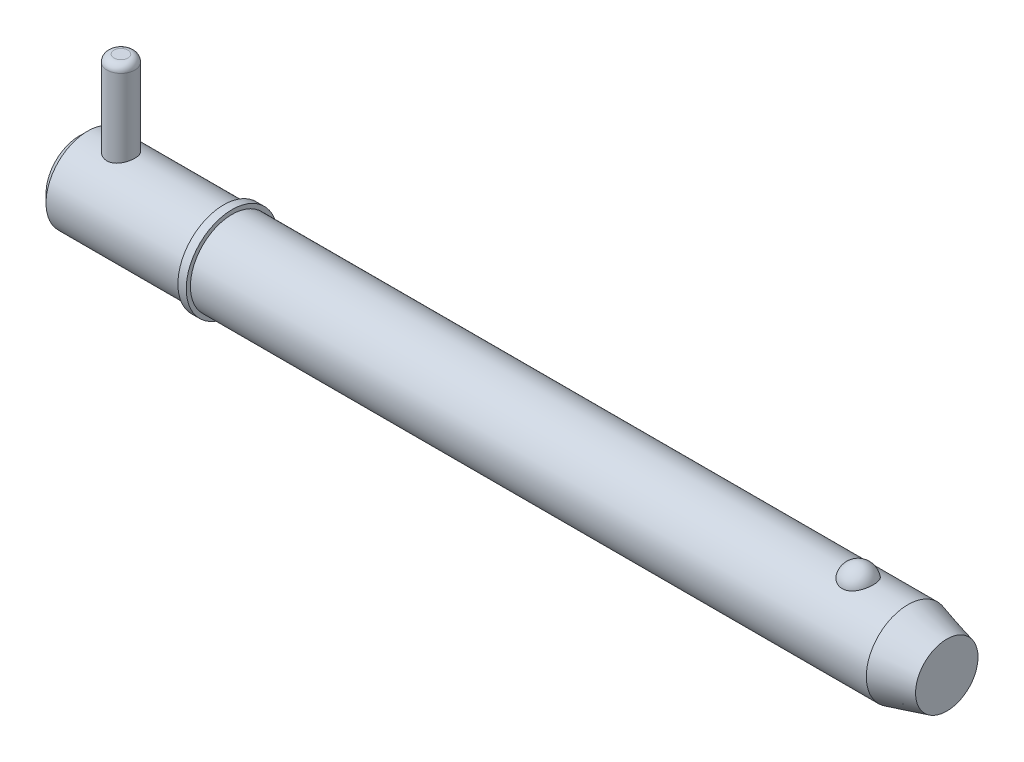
ISO-10303-21;
HEADER;
FILE_DESCRIPTION(('STEP AP214'),'2;1');
FILE_NAME('part.step','',(''),(''),'','','');
FILE_SCHEMA(('AUTOMOTIVE_DESIGN { 1 0 10303 214 1 1 1 1 }'));
ENDSEC;
DATA;
#1=APPLICATION_CONTEXT('core data for automotive mechanical design processes');
#2=APPLICATION_PROTOCOL_DEFINITION('international standard','automotive_design',2000,#1);
#3=PRODUCT_CONTEXT('',#1,'mechanical');
#4=PRODUCT('Part','Part','',(#3));
#5=PRODUCT_RELATED_PRODUCT_CATEGORY('part','',(#4));
#6=PRODUCT_DEFINITION_FORMATION('','',#4);
#7=PRODUCT_DEFINITION_CONTEXT('part definition',#1,'design');
#8=PRODUCT_DEFINITION('design','',#6,#7);
#9=PRODUCT_DEFINITION_SHAPE('','',#8);
#10=(LENGTH_UNIT() NAMED_UNIT(*) SI_UNIT(.MILLI.,.METRE.));
#11=(NAMED_UNIT(*) PLANE_ANGLE_UNIT() SI_UNIT($,.RADIAN.));
#12=(NAMED_UNIT(*) SI_UNIT($,.STERADIAN.) SOLID_ANGLE_UNIT());
#13=UNCERTAINTY_MEASURE_WITH_UNIT(LENGTH_MEASURE(1.E-05),#10,'distance_accuracy_value','');
#14=(GEOMETRIC_REPRESENTATION_CONTEXT(3) GLOBAL_UNCERTAINTY_ASSIGNED_CONTEXT((#13)) GLOBAL_UNIT_ASSIGNED_CONTEXT((#10,
#11,#12)) REPRESENTATION_CONTEXT('',''));
#15=CARTESIAN_POINT('',(0.,0.,0.));
#16=DIRECTION('',(0.,0.,1.));
#17=DIRECTION('',(1.,0.,0.));
#18=AXIS2_PLACEMENT_3D('',#15,#16,#17);
#19=CARTESIAN_POINT('',(9.52500000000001,28.575,0.));
#20=DIRECTION('',(0.,-1.,0.));
#21=DIRECTION('',(0.,0.,-1.));
#22=AXIS2_PLACEMENT_3D('',#19,#20,#21);
#23=CYLINDRICAL_SURFACE('',#22,3.175);
#24=CARTESIAN_POINT('',(9.52500000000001,-7.93750000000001,0.));
#25=DIRECTION('',(0.,1.,0.));
#26=DIRECTION('',(0.,0.,1.));
#27=AXIS2_PLACEMENT_3D('',#24,#25,#26);
#28=CIRCLE('',#27,3.175);
#29=CARTESIAN_POINT('',(9.52500000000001,-7.93750000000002,-3.175));
#30=VERTEX_POINT('',#29);
#31=EDGE_CURVE('P0_E25',#30,#30,#28,.T.);
#32=CARTESIAN_POINT('',(9.52500000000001,26.9875,0.));
#33=DIRECTION('',(0.,1.,0.));
#34=DIRECTION('',(0.,0.,1.));
#35=AXIS2_PLACEMENT_3D('',#32,#33,#34);
#36=CIRCLE('',#35,3.175);
#37=CARTESIAN_POINT('',(9.52500000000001,26.9875,-3.175));
#38=VERTEX_POINT('',#37);
#39=EDGE_CURVE('P0_E29',#38,#38,#36,.F.);
#40=CARTESIAN_POINT('',(9.52500000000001,-7.93750000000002,-3.175));
#41=CARTESIAN_POINT('',(9.52500000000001,-7.57369791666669,-3.175));
#42=CARTESIAN_POINT('',(9.52500000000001,-7.20989583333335,-3.175));
#43=CARTESIAN_POINT('',(9.52500000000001,-6.48229166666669,-3.175));
#44=CARTESIAN_POINT('',(9.52500000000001,-6.11848958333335,-3.175));
#45=CARTESIAN_POINT('',(9.52500000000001,-5.39088541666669,-3.175));
#46=CARTESIAN_POINT('',(9.52500000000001,-5.02708333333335,-3.175));
#47=CARTESIAN_POINT('',(9.52500000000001,-4.29947916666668,-3.175));
#48=CARTESIAN_POINT('',(9.52500000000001,-3.93567708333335,-3.175));
#49=CARTESIAN_POINT('',(9.52500000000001,-3.20807291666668,-3.175));
#50=CARTESIAN_POINT('',(9.52500000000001,-2.84427083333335,-3.175));
#51=CARTESIAN_POINT('',(9.52500000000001,-2.11666666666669,-3.175));
#52=CARTESIAN_POINT('',(9.52500000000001,-1.75286458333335,-3.175));
#53=CARTESIAN_POINT('',(9.52500000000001,-1.02526041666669,-3.175));
#54=CARTESIAN_POINT('',(9.52500000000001,-0.661458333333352,-3.175));
#55=CARTESIAN_POINT('',(9.52500000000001,0.0661458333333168,-3.175));
#56=CARTESIAN_POINT('',(9.52500000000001,0.429947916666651,-3.175));
#57=CARTESIAN_POINT('',(9.52500000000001,1.15755208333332,-3.175));
#58=CARTESIAN_POINT('',(9.52500000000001,1.52135416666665,-3.175));
#59=CARTESIAN_POINT('',(9.52500000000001,2.24895833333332,-3.175));
#60=CARTESIAN_POINT('',(9.52500000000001,2.61276041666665,-3.175));
#61=CARTESIAN_POINT('',(9.52500000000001,3.34036458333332,-3.175));
#62=CARTESIAN_POINT('',(9.52500000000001,3.70416666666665,-3.175));
#63=CARTESIAN_POINT('',(9.52500000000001,4.43177083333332,-3.175));
#64=CARTESIAN_POINT('',(9.52500000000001,4.79557291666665,-3.175));
#65=CARTESIAN_POINT('',(9.52500000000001,5.52317708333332,-3.175));
#66=CARTESIAN_POINT('',(9.52500000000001,5.88697916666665,-3.175));
#67=CARTESIAN_POINT('',(9.52500000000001,6.61458333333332,-3.175));
#68=CARTESIAN_POINT('',(9.52500000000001,6.97838541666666,-3.175));
#69=CARTESIAN_POINT('',(9.52500000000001,7.70598958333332,-3.175));
#70=CARTESIAN_POINT('',(9.52500000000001,8.06979166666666,-3.175));
#71=CARTESIAN_POINT('',(9.52500000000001,8.79739583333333,-3.175));
#72=CARTESIAN_POINT('',(9.52500000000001,9.16119791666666,-3.175));
#73=CARTESIAN_POINT('',(9.52500000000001,9.88880208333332,-3.175));
#74=CARTESIAN_POINT('',(9.52500000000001,10.2526041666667,-3.175));
#75=CARTESIAN_POINT('',(9.52500000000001,10.9802083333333,-3.175));
#76=CARTESIAN_POINT('',(9.52500000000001,11.3440104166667,-3.175));
#77=CARTESIAN_POINT('',(9.52500000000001,12.0716145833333,-3.175));
#78=CARTESIAN_POINT('',(9.52500000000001,12.4354166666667,-3.175));
#79=CARTESIAN_POINT('',(9.52500000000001,13.1630208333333,-3.175));
#80=CARTESIAN_POINT('',(9.52500000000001,13.5268229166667,-3.175));
#81=CARTESIAN_POINT('',(9.52500000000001,14.2544270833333,-3.175));
#82=CARTESIAN_POINT('',(9.52500000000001,14.6182291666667,-3.175));
#83=CARTESIAN_POINT('',(9.52500000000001,15.3458333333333,-3.175));
#84=CARTESIAN_POINT('',(9.52500000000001,15.7096354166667,-3.175));
#85=CARTESIAN_POINT('',(9.52500000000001,16.4372395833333,-3.175));
#86=CARTESIAN_POINT('',(9.52500000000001,16.8010416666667,-3.175));
#87=CARTESIAN_POINT('',(9.52500000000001,17.5286458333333,-3.175));
#88=CARTESIAN_POINT('',(9.52500000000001,17.8924479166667,-3.175));
#89=CARTESIAN_POINT('',(9.52500000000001,18.6200520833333,-3.175));
#90=CARTESIAN_POINT('',(9.52500000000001,18.9838541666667,-3.175));
#91=CARTESIAN_POINT('',(9.52500000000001,19.7114583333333,-3.175));
#92=CARTESIAN_POINT('',(9.52500000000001,20.0752604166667,-3.175));
#93=CARTESIAN_POINT('',(9.52500000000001,20.8028645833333,-3.175));
#94=CARTESIAN_POINT('',(9.52500000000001,21.1666666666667,-3.175));
#95=CARTESIAN_POINT('',(9.52500000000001,21.8942708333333,-3.175));
#96=CARTESIAN_POINT('',(9.52500000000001,22.2580729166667,-3.175));
#97=CARTESIAN_POINT('',(9.52500000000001,22.9856770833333,-3.175));
#98=CARTESIAN_POINT('',(9.52500000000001,23.3494791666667,-3.175));
#99=CARTESIAN_POINT('',(9.52500000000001,24.0770833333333,-3.175));
#100=CARTESIAN_POINT('',(9.52500000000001,24.4408854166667,-3.175));
#101=CARTESIAN_POINT('',(9.52500000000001,25.1684895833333,-3.175));
#102=CARTESIAN_POINT('',(9.52500000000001,25.5322916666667,-3.175));
#103=CARTESIAN_POINT('',(9.52500000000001,26.2598958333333,-3.175));
#104=CARTESIAN_POINT('',(9.52500000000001,26.6236979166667,-3.175));
#105=CARTESIAN_POINT('',(9.52500000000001,26.9875,-3.175));
#106=B_SPLINE_CURVE_WITH_KNOTS('',3,(#40,#41,#42,#43,#44,#45,#46,#47,#48,#49,#50,#51,#52,#53,
#54,#55,#56,#57,#58,#59,#60,#61,#62,#63,#64,#65,#66,#67,#68,#69,#70,#71,#72,#73,#74,#75,#76,#77,
#78,#79,#80,#81,#82,#83,#84,#85,#86,#87,#88,#89,#90,#91,#92,#93,#94,#95,#96,#97,#98,#99,#100,
#101,#102,#103,#104,#105),.UNSPECIFIED.,.F.,.F.,(4,2,2,2,2,2,2,2,2,2,2,2,2,2,2,2,2,2,2,2,2,2,2,
2,2,2,2,2,2,2,2,2,4),(0.,1.09140625,2.1828125,3.27421875,4.365625,5.45703125,6.5484375,
7.63984375,8.73125000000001,9.82265625,10.9140625,12.00546875,13.096875,14.18828125,15.2796875,
16.37109375,17.4625,18.55390625,19.6453125,20.73671875,21.828125,22.91953125,24.0109375,
25.10234375,26.19375,27.28515625,28.3765625,29.46796875,30.559375,31.65078125,32.7421875,
33.83359375,34.925),.UNSPECIFIED.);
#107=EDGE_CURVE('P0_BSEAM14',#30,#38,#106,.T.);
#108=ORIENTED_EDGE('',*,*,#31,.T.);
#109=ORIENTED_EDGE('',*,*,#39,.T.);
#110=ORIENTED_EDGE('',*,*,#107,.T.);
#111=ORIENTED_EDGE('',*,*,#107,.F.);
#112=EDGE_LOOP('',(#108,#110,#109,#111));
#113=FACE_BOUND('',#112,.T.);
#114=ADVANCED_FACE('P0_F14',(#113),#23,.T.);
#115=CARTESIAN_POINT('',(9.52500000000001,28.575,0.));
#116=DIRECTION('',(0.,1.,0.));
#117=DIRECTION('',(0.,0.,1.));
#118=AXIS2_PLACEMENT_3D('',#115,#116,#117);
#119=PLANE('',#118);
#120=CARTESIAN_POINT('',(9.52500000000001,28.575,0.));
#121=DIRECTION('',(0.,1.,0.));
#122=DIRECTION('',(0.,0.,1.));
#123=AXIS2_PLACEMENT_3D('',#120,#121,#122);
#124=CIRCLE('',#123,1.5875);
#125=CARTESIAN_POINT('',(9.52500000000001,28.575,1.5875));
#126=VERTEX_POINT('',#125);
#127=EDGE_CURVE('P0_E10',#126,#126,#124,.T.);
#128=ORIENTED_EDGE('',*,*,#127,.T.);
#129=EDGE_LOOP('',(#128));
#130=FACE_BOUND('',#129,.T.);
#131=ADVANCED_FACE('P0_F46',(#130),#119,.T.);
#132=CARTESIAN_POINT('',(9.52500000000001,-9.525,0.));
#133=DIRECTION('',(0.,1.,0.));
#134=DIRECTION('',(0.,0.,1.));
#135=AXIS2_PLACEMENT_3D('',#132,#133,#134);
#136=PLANE('',#135);
#137=CARTESIAN_POINT('',(9.52500000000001,-9.525,0.));
#138=DIRECTION('',(0.,1.,0.));
#139=DIRECTION('',(0.,0.,1.));
#140=AXIS2_PLACEMENT_3D('',#137,#138,#139);
#141=CIRCLE('',#140,1.5875);
#142=CARTESIAN_POINT('',(9.52500000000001,-9.525,1.5875));
#143=VERTEX_POINT('',#142);
#144=EDGE_CURVE('P0_E21',#143,#143,#141,.F.);
#145=ORIENTED_EDGE('',*,*,#144,.T.);
#146=EDGE_LOOP('',(#145));
#147=FACE_BOUND('',#146,.T.);
#148=ADVANCED_FACE('P0_F43',(#147),#136,.F.);
#149=CARTESIAN_POINT('',(9.52500000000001,-7.9375,0.));
#150=DIRECTION('',(0.,1.,0.));
#151=DIRECTION('',(0.,0.,1.));
#152=AXIS2_PLACEMENT_3D('',#149,#150,#151);
#153=DEGENERATE_TOROIDAL_SURFACE('',#152,1.5875,1.5875,.T.);
#154=ORIENTED_EDGE('',*,*,#144,.F.);
#155=EDGE_LOOP('',(#154));
#156=FACE_BOUND('',#155,.T.);
#157=ORIENTED_EDGE('',*,*,#31,.F.);
#158=EDGE_LOOP('',(#157));
#159=FACE_BOUND('',#158,.T.);
#160=ADVANCED_FACE('P0_F38',(#156,#159),#153,.T.);
#161=CARTESIAN_POINT('',(9.52500000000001,26.9875,0.));
#162=DIRECTION('',(0.,1.,0.));
#163=DIRECTION('',(0.,0.,1.));
#164=AXIS2_PLACEMENT_3D('',#161,#162,#163);
#165=DEGENERATE_TOROIDAL_SURFACE('',#164,1.5875,1.5875,.T.);
#166=ORIENTED_EDGE('',*,*,#39,.F.);
#167=EDGE_LOOP('',(#166));
#168=FACE_BOUND('',#167,.T.);
#169=ORIENTED_EDGE('',*,*,#127,.F.);
#170=EDGE_LOOP('',(#169));
#171=FACE_BOUND('',#170,.T.);
#172=ADVANCED_FACE('P0_F16',(#168,#171),#165,.T.);
#173=CLOSED_SHELL('',(#114,#131,#148,#160,#172));
#174=MANIFOLD_SOLID_BREP('P0_B1',#173);
#175=CARTESIAN_POINT('',(0.,0.,0.));
#176=DIRECTION('',(1.,0.,0.));
#177=DIRECTION('',(0.,0.,-1.));
#178=AXIS2_PLACEMENT_3D('',#175,#176,#177);
#179=CYLINDRICAL_SURFACE('',#178,9.525);
#180=CARTESIAN_POINT('',(189.543054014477,0.,0.));
#181=DIRECTION('',(1.,0.,0.));
#182=DIRECTION('',(0.,0.,-1.));
#183=AXIS2_PLACEMENT_3D('',#180,#181,#182);
#184=CIRCLE('',#183,9.525);
#185=CARTESIAN_POINT('',(189.543054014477,0.,-9.525));
#186=VERTEX_POINT('',#185);
#187=EDGE_CURVE('P1_E81',#186,#186,#184,.T.);
#188=ORIENTED_EDGE('',*,*,#187,.F.);
#189=EDGE_LOOP('',(#188));
#190=FACE_BOUND('',#189,.T.);
#191=CARTESIAN_POINT('',(34.93,0.,0.));
#192=DIRECTION('',(1.,0.,0.));
#193=DIRECTION('',(0.,0.,-1.));
#194=AXIS2_PLACEMENT_3D('',#191,#192,#193);
#195=CIRCLE('',#194,9.525);
#196=CARTESIAN_POINT('',(34.93,0.,-9.525));
#197=VERTEX_POINT('',#196);
#198=EDGE_CURVE('P1_E85',#197,#197,#195,.T.);
#199=ORIENTED_EDGE('',*,*,#198,.T.);
#200=EDGE_LOOP('',(#199));
#201=FACE_BOUND('',#200,.T.);
#202=CARTESIAN_POINT('',(178.145757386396,8.80405803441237,3.63513233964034));
#203=CARTESIAN_POINT('',(178.051676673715,8.80405953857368,3.63513053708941));
#204=CARTESIAN_POINT('',(177.957561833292,8.80561325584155,3.63137461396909));
#205=CARTESIAN_POINT('',(177.770012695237,8.81177748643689,3.61638665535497));
#206=CARTESIAN_POINT('',(177.676578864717,8.81638992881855,3.60514990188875));
#207=CARTESIAN_POINT('',(177.397945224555,8.83467114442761,3.56024627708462));
#208=CARTESIAN_POINT('',(177.214691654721,8.85278327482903,3.5153862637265));
#209=CARTESIAN_POINT('',(176.859509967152,8.89871214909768,3.39742145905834));
#210=CARTESIAN_POINT('',(176.687553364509,8.92650327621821,3.32439116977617));
#211=CARTESIAN_POINT('',(176.358707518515,8.9887481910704,3.15220244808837));
#212=CARTESIAN_POINT('',(176.201811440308,9.02319893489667,3.05305594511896));
#213=CARTESIAN_POINT('',(175.902214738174,9.09629186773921,2.82797815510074));
#214=CARTESIAN_POINT('',(175.760060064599,9.13502685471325,2.70135138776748));
#215=CARTESIAN_POINT('',(175.498299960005,9.2118657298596,2.42641932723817));
#216=CARTESIAN_POINT('',(175.378701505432,9.24996941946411,2.27810735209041));
#217=CARTESIAN_POINT('',(175.159645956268,9.32341082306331,1.95652290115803));
#218=CARTESIAN_POINT('',(175.061317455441,9.35855090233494,1.78243511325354));
#219=CARTESIAN_POINT('',(174.893819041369,9.42045142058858,1.41937246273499));
#220=CARTESIAN_POINT('',(174.824651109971,9.44721128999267,1.23039658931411));
#221=CARTESIAN_POINT('',(174.716199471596,9.48990641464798,0.840370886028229));
#222=CARTESIAN_POINT('',(174.677288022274,9.50570658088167,0.639202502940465));
#223=CARTESIAN_POINT('',(174.631555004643,9.52433146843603,0.232664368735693));
#224=CARTESIAN_POINT('',(174.624732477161,9.52715657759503,0.0272947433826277));
#225=CARTESIAN_POINT('',(174.643255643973,9.51956918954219,-0.380478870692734));
#226=CARTESIAN_POINT('',(174.668405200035,9.50923740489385,-0.582893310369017));
#227=CARTESIAN_POINT('',(174.75002537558,9.47651897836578,-0.980293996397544));
#228=CARTESIAN_POINT('',(174.806496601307,9.45413210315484,-1.17528009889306));
#229=CARTESIAN_POINT('',(174.949719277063,9.39954044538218,-1.55263697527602));
#230=CARTESIAN_POINT('',(175.036512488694,9.36732213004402,-1.73498993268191));
#231=CARTESIAN_POINT('',(175.238610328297,9.29640700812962,-2.08177763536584));
#232=CARTESIAN_POINT('',(175.353917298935,9.25770966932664,-2.24621090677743));
#233=CARTESIAN_POINT('',(175.611264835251,9.17775604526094,-2.5533833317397));
#234=CARTESIAN_POINT('',(175.753434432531,9.136488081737,-2.696011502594));
#235=CARTESIAN_POINT('',(176.06089985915,9.05620497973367,-2.95451229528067));
#236=CARTESIAN_POINT('',(176.226193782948,9.01718965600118,-3.07038711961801));
#237=CARTESIAN_POINT('',(176.572052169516,8.94680019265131,-3.26976836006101));
#238=CARTESIAN_POINT('',(176.752227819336,8.91528408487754,-3.35389750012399));
#239=CARTESIAN_POINT('',(177.125651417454,8.86272514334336,-3.49043503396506));
#240=CARTESIAN_POINT('',(177.318894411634,8.84167836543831,-3.54285537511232));
#241=CARTESIAN_POINT('',(177.702503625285,8.81348056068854,-3.61241306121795));
#242=CARTESIAN_POINT('',(177.892525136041,8.80568348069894,-3.6311933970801));
#243=CARTESIAN_POINT('',(178.273190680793,8.80289410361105,-3.63795342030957));
#244=CARTESIAN_POINT('',(178.463834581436,8.80789922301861,-3.62593932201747));
#245=CARTESIAN_POINT('',(178.834007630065,8.82974915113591,-3.57238430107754));
#246=CARTESIAN_POINT('',(179.013697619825,8.84621463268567,-3.53178890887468));
#247=CARTESIAN_POINT('',(179.363422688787,8.88875330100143,-3.42331083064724));
#248=CARTESIAN_POINT('',(179.533456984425,8.91482726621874,-3.35542593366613));
#249=CARTESIAN_POINT('',(179.863237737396,8.97448239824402,-3.19248225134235));
#250=CARTESIAN_POINT('',(180.022680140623,9.00821446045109,-3.0968647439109));
#251=CARTESIAN_POINT('',(180.323513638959,9.07935398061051,-2.88162736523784));
#252=CARTESIAN_POINT('',(180.464900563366,9.11676228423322,-2.76200196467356));
#253=CARTESIAN_POINT('',(180.73331931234,9.19347419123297,-2.49516285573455));
#254=CARTESIAN_POINT('',(180.859275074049,9.23277872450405,-2.34686614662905));
#255=CARTESIAN_POINT('',(181.085522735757,9.3073761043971,-2.03093683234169));
#256=CARTESIAN_POINT('',(181.18581004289,9.34266823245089,-1.86330077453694));
#257=CARTESIAN_POINT('',(181.361514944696,9.40674710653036,-1.50744893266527));
#258=CARTESIAN_POINT('',(181.436041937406,9.43529176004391,-1.31874876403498));
#259=CARTESIAN_POINT('',(181.55416505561,9.48144132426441,-0.930631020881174));
#260=CARTESIAN_POINT('',(181.597760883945,9.49904612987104,-0.731213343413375));
#261=CARTESIAN_POINT('',(181.653158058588,9.5215314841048,-0.327147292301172));
#262=CARTESIAN_POINT('',(181.664935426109,9.52640243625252,-0.122495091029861));
#263=CARTESIAN_POINT('',(181.656382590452,9.5228957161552,0.28601848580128));
#264=CARTESIAN_POINT('',(181.63605305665,9.5145183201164,0.489879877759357));
#265=CARTESIAN_POINT('',(181.563884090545,9.48544083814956,0.889994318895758));
#266=CARTESIAN_POINT('',(181.512199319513,9.46480124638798,1.08627971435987));
#267=CARTESIAN_POINT('',(181.378491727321,9.4133389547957,1.46682086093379));
#268=CARTESIAN_POINT('',(181.296466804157,9.38251554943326,1.65107577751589));
#269=CARTESIAN_POINT('',(181.10319292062,9.31365636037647,2.00346348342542));
#270=CARTESIAN_POINT('',(180.991783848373,9.27558138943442,2.17150083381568));
#271=CARTESIAN_POINT('',(180.742294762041,9.19638714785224,2.48563115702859));
#272=CARTESIAN_POINT('',(180.604216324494,9.15526805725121,2.63172542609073));
#273=CARTESIAN_POINT('',(180.304843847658,9.07465393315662,2.89750997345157));
#274=CARTESIAN_POINT('',(180.143610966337,9.03515496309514,3.01726776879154));
#275=CARTESIAN_POINT('',(179.801613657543,8.96227564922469,3.22732920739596));
#276=CARTESIAN_POINT('',(179.620841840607,8.92889763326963,3.31762165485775));
#277=CARTESIAN_POINT('',(179.251445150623,8.8734538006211,3.46314419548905));
#278=CARTESIAN_POINT('',(179.06332371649,8.85102983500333,3.51950082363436));
#279=CARTESIAN_POINT('',(178.77578699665,8.8266696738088,3.57993683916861));
#280=CARTESIAN_POINT('',(178.679133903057,8.82009725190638,3.5960621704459));
#281=CARTESIAN_POINT('',(178.484677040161,8.81020897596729,3.62022512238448));
#282=CARTESIAN_POINT('',(178.386874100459,8.80689090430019,3.62826825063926));
#283=CARTESIAN_POINT('',(178.241224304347,8.80445615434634,3.63416760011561));
#284=CARTESIAN_POINT('',(178.193495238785,8.80405727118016,3.63513325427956));
#285=CARTESIAN_POINT('',(178.145757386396,8.80405803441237,3.63513233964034));
#286=B_SPLINE_CURVE_WITH_KNOTS('',3,(#202,#203,#204,#205,#206,#207,#208,#209,#210,#211,#212,
#213,#214,#215,#216,#217,#218,#219,#220,#221,#222,#223,#224,#225,#226,#227,#228,#229,#230,#231,
#232,#233,#234,#235,#236,#237,#238,#239,#240,#241,#242,#243,#244,#245,#246,#247,#248,#249,#250,
#251,#252,#253,#254,#255,#256,#257,#258,#259,#260,#261,#262,#263,#264,#265,#266,#267,#268,#269,
#270,#271,#272,#273,#274,#275,#276,#277,#278,#279,#280,#281,#282,#283,#284,#285),.UNSPECIFIED.,
.T.,.F.,(4,2,2,2,2,2,2,2,2,2,2,2,2,2,2,2,2,2,2,2,2,2,2,2,2,2,2,2,2,2,2,2,2,2,2,2,2,2,2,2,2,4),
(0.,0.282202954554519,0.564584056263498,1.13017050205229,1.69427128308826,2.25811483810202,
2.83836627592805,3.41879688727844,4.02497117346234,4.63118665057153,5.24474754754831,
5.85829010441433,6.46808687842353,7.07789545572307,7.68854723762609,8.299249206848,
8.91296283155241,9.52662591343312,10.1275338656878,10.7282152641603,11.2986646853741,
11.8689989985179,12.4213015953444,12.973648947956,13.5380053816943,14.1024919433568,
14.695298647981,15.2882113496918,15.8999469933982,16.5116885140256,17.1238909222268,
17.7360805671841,18.3452748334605,18.9545113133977,19.567138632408,20.179729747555,
20.7907316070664,21.4019653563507,21.9915938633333,22.2859053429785,22.5800161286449,
22.7232098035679),.UNSPECIFIED.);
#287=CARTESIAN_POINT('',(178.145757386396,8.80405803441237,3.63513233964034));
#288=VERTEX_POINT('',#287);
#289=EDGE_CURVE('P1_E35',#288,#288,#286,.T.);
#290=ORIENTED_EDGE('',*,*,#289,.T.);
#291=EDGE_LOOP('',(#290));
#292=FACE_BOUND('',#291,.T.);
#293=ADVANCED_FACE('P1_F13',(#190,#201,#292),#179,.T.);
#294=CARTESIAN_POINT('',(0.,0.,0.));
#295=DIRECTION('',(-1.,0.,0.));
#296=DIRECTION('',(0.,0.,1.));
#297=AXIS2_PLACEMENT_3D('',#294,#295,#296);
#298=PLANE('',#297);
#299=CARTESIAN_POINT('',(0.,0.,0.));
#300=DIRECTION('',(1.,0.,0.));
#301=DIRECTION('',(0.,0.,-1.));
#302=AXIS2_PLACEMENT_3D('',#299,#300,#301);
#303=CIRCLE('',#302,7.62);
#304=CARTESIAN_POINT('',(0.,0.,-7.62));
#305=VERTEX_POINT('',#304);
#306=EDGE_CURVE('P1_E9',#305,#305,#303,.T.);
#307=ORIENTED_EDGE('',*,*,#306,.F.);
#308=EDGE_LOOP('',(#307));
#309=FACE_BOUND('',#308,.T.);
#310=ADVANCED_FACE('P1_F15',(#309),#298,.T.);
#311=CARTESIAN_POINT('',(1.90499999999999,0.,0.));
#312=DIRECTION('',(1.,0.,0.));
#313=DIRECTION('',(0.,0.,-1.));
#314=AXIS2_PLACEMENT_3D('',#311,#312,#313);
#315=CONICAL_SURFACE('',#314,9.525,0.785398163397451);
#316=ORIENTED_EDGE('',*,*,#306,.T.);
#317=EDGE_LOOP('',(#316));
#318=FACE_BOUND('',#317,.T.);
#319=CARTESIAN_POINT('',(1.90499999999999,0.,0.));
#320=DIRECTION('',(1.,0.,0.));
#321=DIRECTION('',(0.,0.,-1.));
#322=AXIS2_PLACEMENT_3D('',#319,#320,#321);
#323=CIRCLE('',#322,9.525);
#324=CARTESIAN_POINT('',(1.90499999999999,0.,-9.525));
#325=VERTEX_POINT('',#324);
#326=EDGE_CURVE('P1_E26',#325,#325,#323,.T.);
#327=ORIENTED_EDGE('',*,*,#326,.F.);
#328=EDGE_LOOP('',(#327));
#329=FACE_BOUND('',#328,.T.);
#330=ADVANCED_FACE('P1_F77',(#318,#329),#315,.T.);
#331=CARTESIAN_POINT('',(0.,0.,0.));
#332=DIRECTION('',(1.,0.,0.));
#333=DIRECTION('',(0.,0.,-1.));
#334=AXIS2_PLACEMENT_3D('',#331,#332,#333);
#335=CYLINDRICAL_SURFACE('',#334,9.525);
#336=CARTESIAN_POINT('',(9.525,-8.98025612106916,3.175));
#337=CARTESIAN_POINT('',(9.35206354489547,-8.98025555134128,3.17500081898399));
#338=CARTESIAN_POINT('',(9.17913201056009,-8.98530617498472,3.16082293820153));
#339=CARTESIAN_POINT('',(8.83839221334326,-9.00485797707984,3.10467734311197));
#340=CARTESIAN_POINT('',(8.67058479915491,-9.0193607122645,3.06270505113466));
#341=CARTESIAN_POINT('',(8.34508461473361,-9.05599546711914,2.95260866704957));
#342=CARTESIAN_POINT('',(8.18737272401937,-9.07811252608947,2.88453582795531));
#343=CARTESIAN_POINT('',(7.88555684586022,-9.12746212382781,2.72434567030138));
#344=CARTESIAN_POINT('',(7.74145587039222,-9.1546957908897,2.63222304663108));
#345=CARTESIAN_POINT('',(7.46531411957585,-9.21240503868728,2.42268738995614));
#346=CARTESIAN_POINT('',(7.33388351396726,-9.24296141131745,2.30449228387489));
#347=CARTESIAN_POINT('',(7.09229340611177,-9.30319020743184,2.0478358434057));
#348=CARTESIAN_POINT('',(6.98213731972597,-9.33286248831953,1.90937126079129));
#349=CARTESIAN_POINT('',(6.78345450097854,-9.38891527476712,1.61164431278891));
#350=CARTESIAN_POINT('',(6.69556709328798,-9.41518969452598,1.45193356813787));
#351=CARTESIAN_POINT('',(6.54814671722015,-9.46053437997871,1.11896913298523));
#352=CARTESIAN_POINT('',(6.48860610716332,-9.47960658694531,0.945719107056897));
#353=CARTESIAN_POINT('',(6.40163866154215,-9.50782564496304,0.596991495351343));
#354=CARTESIAN_POINT('',(6.373166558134,-9.5172947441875,0.421801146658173));
#355=CARTESIAN_POINT('',(6.3458207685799,-9.52638456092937,0.068890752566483));
#356=CARTESIAN_POINT('',(6.34693945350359,-9.52600781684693,-0.108828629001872));
#357=CARTESIAN_POINT('',(6.37808050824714,-9.51566675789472,-0.454353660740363));
#358=CARTESIAN_POINT('',(6.4069675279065,-9.50607905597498,-0.622274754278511));
#359=CARTESIAN_POINT('',(6.490947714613,-9.47886621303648,-0.950732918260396));
#360=CARTESIAN_POINT('',(6.54604265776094,-9.46124052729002,-1.11126948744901));
#361=CARTESIAN_POINT('',(6.68153768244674,-9.41945253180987,-1.42288410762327));
#362=CARTESIAN_POINT('',(6.76226085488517,-9.3952073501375,-1.57381010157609));
#363=CARTESIAN_POINT('',(6.94645456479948,-9.34270397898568,-1.86030973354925));
#364=CARTESIAN_POINT('',(7.04993142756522,-9.31444467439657,-1.99587908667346));
#365=CARTESIAN_POINT('',(7.28241619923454,-9.25532159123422,-2.2545702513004));
#366=CARTESIAN_POINT('',(7.4123967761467,-9.22439783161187,-2.37680549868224));
#367=CARTESIAN_POINT('',(7.69127470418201,-9.1645528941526,-2.5980302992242));
#368=CARTESIAN_POINT('',(7.84017496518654,-9.13563202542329,-2.6970162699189));
#369=CARTESIAN_POINT('',(8.15547526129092,-9.08273917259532,-2.87016016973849));
#370=CARTESIAN_POINT('',(8.32209451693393,-9.05884361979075,-2.94394402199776));
#371=CARTESIAN_POINT('',(8.66638917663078,-9.01959241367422,-3.06210713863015));
#372=CARTESIAN_POINT('',(8.84405991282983,-9.00423318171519,-3.10649872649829));
#373=CARTESIAN_POINT('',(9.19682677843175,-8.98460345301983,-3.16281207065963));
#374=CARTESIAN_POINT('',(9.37167742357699,-8.9798639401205,-3.17610837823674));
#375=CARTESIAN_POINT('',(9.72113927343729,-8.9806993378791,-3.17374726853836));
#376=CARTESIAN_POINT('',(9.89575051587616,-8.98627237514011,-3.15809511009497));
#377=CARTESIAN_POINT('',(10.2335233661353,-9.00663737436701,-3.09951644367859));
#378=CARTESIAN_POINT('',(10.3968722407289,-9.02110608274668,-3.05754530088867));
#379=CARTESIAN_POINT('',(10.7141759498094,-9.05727657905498,-2.94866651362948));
#380=CARTESIAN_POINT('',(10.8681291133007,-9.07897964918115,-2.88175444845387));
#381=CARTESIAN_POINT('',(11.1676828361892,-9.12802586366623,-2.72248103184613));
#382=CARTESIAN_POINT('',(11.3128635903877,-9.1555260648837,-2.62937980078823));
#383=CARTESIAN_POINT('',(11.5860387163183,-9.21276315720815,-2.42120937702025));
#384=CARTESIAN_POINT('',(11.7140280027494,-9.24250070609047,-2.30613370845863));
#385=CARTESIAN_POINT('',(11.9555513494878,-9.30259247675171,-2.05070616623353));
#386=CARTESIAN_POINT('',(12.0680936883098,-9.33290753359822,-1.90940458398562));
#387=CARTESIAN_POINT('',(12.267933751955,-9.3893275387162,-1.60917665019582));
#388=CARTESIAN_POINT('',(12.3552323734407,-9.41543263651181,-1.45025092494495));
#389=CARTESIAN_POINT('',(12.5013088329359,-9.46036988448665,-1.12007606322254));
#390=CARTESIAN_POINT('',(12.5602723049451,-9.47924920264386,-0.9489158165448));
#391=CARTESIAN_POINT('',(12.6483355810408,-9.50781089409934,-0.598355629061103));
#392=CARTESIAN_POINT('',(12.6774461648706,-9.5174965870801,-0.4189586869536));
#393=CARTESIAN_POINT('',(12.7040070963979,-9.52632915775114,-0.066088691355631));
#394=CARTESIAN_POINT('',(12.7028811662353,-9.52594996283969,0.107266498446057));
#395=CARTESIAN_POINT('',(12.6725130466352,-9.51586223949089,0.451202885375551));
#396=CARTESIAN_POINT('',(12.643273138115,-9.50615446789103,0.621784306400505));
#397=CARTESIAN_POINT('',(12.5584514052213,-9.47867404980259,0.952633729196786));
#398=CARTESIAN_POINT('',(12.5032953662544,-9.46103195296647,1.1130225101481));
#399=CARTESIAN_POINT('',(12.3686013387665,-9.41949985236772,1.42233126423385));
#400=CARTESIAN_POINT('',(12.2890589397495,-9.39560871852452,1.57124915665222));
#401=CARTESIAN_POINT('',(12.1044667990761,-9.34294133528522,1.85938800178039));
#402=CARTESIAN_POINT('',(11.9985831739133,-9.31401720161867,1.9980473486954));
#403=CARTESIAN_POINT('',(11.7657327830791,-9.25490239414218,2.25609475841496));
#404=CARTESIAN_POINT('',(11.6387592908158,-9.22471131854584,2.37547664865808));
#405=CARTESIAN_POINT('',(11.3613902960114,-9.16505913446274,2.59633024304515));
#406=CARTESIAN_POINT('',(11.2102725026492,-9.13567286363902,2.69691791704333));
#407=CARTESIAN_POINT('',(10.8923631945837,-9.08241113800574,2.87119803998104));
#408=CARTESIAN_POINT('',(10.7255757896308,-9.05853424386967,2.94489751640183));
#409=CARTESIAN_POINT('',(10.3887212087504,-9.02021736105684,3.06020415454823));
#410=CARTESIAN_POINT('',(10.219143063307,-9.00539959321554,3.10311136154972));
#411=CARTESIAN_POINT('',(9.87470703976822,-8.98542092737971,3.16050396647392));
#412=CARTESIAN_POINT('',(9.699851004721,-8.98025669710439,3.17499917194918));
#413=CARTESIAN_POINT('',(9.525,-8.98025612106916,3.175));
#414=B_SPLINE_CURVE_WITH_KNOTS('',3,(#336,#337,#338,#339,#340,#341,#342,#343,#344,#345,#346,
#347,#348,#349,#350,#351,#352,#353,#354,#355,#356,#357,#358,#359,#360,#361,#362,#363,#364,#365,
#366,#367,#368,#369,#370,#371,#372,#373,#374,#375,#376,#377,#378,#379,#380,#381,#382,#383,#384,
#385,#386,#387,#388,#389,#390,#391,#392,#393,#394,#395,#396,#397,#398,#399,#400,#401,#402,#403,
#404,#405,#406,#407,#408,#409,#410,#411,#412,#413),.UNSPECIFIED.,.T.,.F.,(4,2,2,2,2,2,2,2,2,2,2,
2,2,2,2,2,2,2,2,2,2,2,2,2,2,2,2,2,2,2,2,2,2,2,2,2,2,2,4),(0.,0.518161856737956,1.03640907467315,
1.55364379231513,2.07099270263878,2.60671746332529,3.14252816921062,3.69231882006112,
4.24196117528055,4.77247962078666,5.30286129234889,5.81244090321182,6.32205505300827,
6.83836754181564,7.3548237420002,7.89559553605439,8.43645060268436,8.98501631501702,
9.53335188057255,10.056948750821,10.5804505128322,11.0859695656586,11.5915782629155,
12.1132237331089,12.6350231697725,13.1819271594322,13.7288117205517,14.2720628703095,
14.815117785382,15.3326491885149,15.8501386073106,16.3594083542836,16.868770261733,
17.3969527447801,17.925304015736,18.4743376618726,19.023227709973,19.5473069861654,
20.0712053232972),.UNSPECIFIED.);
#415=CARTESIAN_POINT('',(9.525,-8.98025612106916,3.175));
#416=VERTEX_POINT('',#415);
#417=EDGE_CURVE('P1_E17',#416,#416,#414,.T.);
#418=ORIENTED_EDGE('',*,*,#417,.F.);
#419=EDGE_LOOP('',(#418));
#420=FACE_BOUND('',#419,.T.);
#421=CARTESIAN_POINT('',(9.525,8.98025612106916,3.175));
#422=CARTESIAN_POINT('',(9.69793645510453,8.98025555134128,3.17500081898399));
#423=CARTESIAN_POINT('',(9.87086798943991,8.98530617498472,3.16082293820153));
#424=CARTESIAN_POINT('',(10.2116077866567,9.00485797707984,3.10467734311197));
#425=CARTESIAN_POINT('',(10.3794152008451,9.0193607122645,3.06270505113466));
#426=CARTESIAN_POINT('',(10.7049153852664,9.05599546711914,2.95260866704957));
#427=CARTESIAN_POINT('',(10.8626272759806,9.07811252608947,2.88453582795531));
#428=CARTESIAN_POINT('',(11.1644431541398,9.12746212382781,2.72434567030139));
#429=CARTESIAN_POINT('',(11.3085441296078,9.15469579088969,2.63222304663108));
#430=CARTESIAN_POINT('',(11.5846858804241,9.21240503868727,2.42268738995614));
#431=CARTESIAN_POINT('',(11.7161164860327,9.24296141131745,2.30449228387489));
#432=CARTESIAN_POINT('',(11.9577065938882,9.30319020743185,2.0478358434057));
#433=CARTESIAN_POINT('',(12.067862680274,9.33286248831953,1.90937126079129));
#434=CARTESIAN_POINT('',(12.2665454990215,9.38891527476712,1.61164431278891));
#435=CARTESIAN_POINT('',(12.354432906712,9.41518969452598,1.45193356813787));
#436=CARTESIAN_POINT('',(12.5018532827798,9.46053437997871,1.11896913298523));
#437=CARTESIAN_POINT('',(12.5613938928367,9.47960658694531,0.945719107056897));
#438=CARTESIAN_POINT('',(12.6483613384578,9.50782564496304,0.596991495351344));
#439=CARTESIAN_POINT('',(12.676833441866,9.5172947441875,0.421801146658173));
#440=CARTESIAN_POINT('',(12.7041792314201,9.52638456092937,0.0688907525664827));
#441=CARTESIAN_POINT('',(12.7030605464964,9.52600781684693,-0.108828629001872));
#442=CARTESIAN_POINT('',(12.6719194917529,9.51566675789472,-0.454353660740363));
#443=CARTESIAN_POINT('',(12.6430324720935,9.50607905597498,-0.622274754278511));
#444=CARTESIAN_POINT('',(12.559052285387,9.47886621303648,-0.950732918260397));
#445=CARTESIAN_POINT('',(12.5039573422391,9.46124052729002,-1.11126948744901));
#446=CARTESIAN_POINT('',(12.3684623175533,9.41945253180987,-1.42288410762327));
#447=CARTESIAN_POINT('',(12.2877391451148,9.3952073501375,-1.57381010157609));
#448=CARTESIAN_POINT('',(12.1035454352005,9.34270397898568,-1.86030973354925));
#449=CARTESIAN_POINT('',(12.0000685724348,9.31444467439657,-1.99587908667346));
#450=CARTESIAN_POINT('',(11.7675838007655,9.25532159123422,-2.2545702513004));
#451=CARTESIAN_POINT('',(11.6376032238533,9.22439783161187,-2.37680549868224));
#452=CARTESIAN_POINT('',(11.358725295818,9.1645528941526,-2.5980302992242));
#453=CARTESIAN_POINT('',(11.2098250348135,9.13563202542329,-2.6970162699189));
#454=CARTESIAN_POINT('',(10.8945247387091,9.08273917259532,-2.87016016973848));
#455=CARTESIAN_POINT('',(10.7279054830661,9.05884361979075,-2.94394402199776));
#456=CARTESIAN_POINT('',(10.3836108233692,9.01959241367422,-3.06210713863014));
#457=CARTESIAN_POINT('',(10.2059400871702,9.00423318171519,-3.10649872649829));
#458=CARTESIAN_POINT('',(9.85317322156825,8.98460345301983,-3.16281207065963));
#459=CARTESIAN_POINT('',(9.67832257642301,8.9798639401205,-3.17610837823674));
#460=CARTESIAN_POINT('',(9.32886072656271,8.9806993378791,-3.17374726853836));
#461=CARTESIAN_POINT('',(9.15424948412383,8.98627237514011,-3.15809511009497));
#462=CARTESIAN_POINT('',(8.81647663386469,9.00663737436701,-3.09951644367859));
#463=CARTESIAN_POINT('',(8.65312775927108,9.02110608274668,-3.05754530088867));
#464=CARTESIAN_POINT('',(8.33582405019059,9.05727657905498,-2.94866651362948));
#465=CARTESIAN_POINT('',(8.18187088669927,9.07897964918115,-2.88175444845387));
#466=CARTESIAN_POINT('',(7.88231716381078,9.12802586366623,-2.72248103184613));
#467=CARTESIAN_POINT('',(7.73713640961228,9.1555260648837,-2.62937980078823));
#468=CARTESIAN_POINT('',(7.46396128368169,9.21276315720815,-2.42120937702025));
#469=CARTESIAN_POINT('',(7.33597199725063,9.24250070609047,-2.30613370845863));
#470=CARTESIAN_POINT('',(7.09444865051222,9.30259247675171,-2.05070616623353));
#471=CARTESIAN_POINT('',(6.98190631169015,9.33290753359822,-1.90940458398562));
#472=CARTESIAN_POINT('',(6.78206624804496,9.3893275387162,-1.60917665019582));
#473=CARTESIAN_POINT('',(6.6947676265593,9.41543263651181,-1.45025092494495));
#474=CARTESIAN_POINT('',(6.54869116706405,9.46036988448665,-1.12007606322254));
#475=CARTESIAN_POINT('',(6.48972769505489,9.47924920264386,-0.948915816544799));
#476=CARTESIAN_POINT('',(6.40166441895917,9.50781089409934,-0.598355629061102));
#477=CARTESIAN_POINT('',(6.3725538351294,9.5174965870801,-0.418958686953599));
#478=CARTESIAN_POINT('',(6.34599290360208,9.52632915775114,-0.0660886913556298));
#479=CARTESIAN_POINT('',(6.3471188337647,9.52594996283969,0.107266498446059));
#480=CARTESIAN_POINT('',(6.37748695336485,9.51586223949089,0.451202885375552));
#481=CARTESIAN_POINT('',(6.40672686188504,9.50615446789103,0.621784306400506));
#482=CARTESIAN_POINT('',(6.49154859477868,9.47867404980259,0.952633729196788));
#483=CARTESIAN_POINT('',(6.54670463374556,9.46103195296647,1.11302251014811));
#484=CARTESIAN_POINT('',(6.68139866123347,9.41949985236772,1.42233126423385));
#485=CARTESIAN_POINT('',(6.76094106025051,9.39560871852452,1.57124915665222));
#486=CARTESIAN_POINT('',(6.94553320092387,9.34294133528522,1.85938800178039));
#487=CARTESIAN_POINT('',(7.05141682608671,9.31401720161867,1.9980473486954));
#488=CARTESIAN_POINT('',(7.28426721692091,9.25490239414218,2.25609475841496));
#489=CARTESIAN_POINT('',(7.41124070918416,9.22471131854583,2.37547664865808));
#490=CARTESIAN_POINT('',(7.68860970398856,9.16505913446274,2.59633024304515));
#491=CARTESIAN_POINT('',(7.83972749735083,9.13567286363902,2.69691791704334));
#492=CARTESIAN_POINT('',(8.15763680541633,9.08241113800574,2.87119803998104));
#493=CARTESIAN_POINT('',(8.32442421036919,9.05853424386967,2.94489751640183));
#494=CARTESIAN_POINT('',(8.66127879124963,9.02021736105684,3.06020415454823));
#495=CARTESIAN_POINT('',(8.83085693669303,9.00539959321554,3.10311136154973));
#496=CARTESIAN_POINT('',(9.17529296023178,8.98542092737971,3.16050396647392));
#497=CARTESIAN_POINT('',(9.350148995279,8.98025669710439,3.17499917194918));
#498=CARTESIAN_POINT('',(9.525,8.98025612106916,3.175));
#499=B_SPLINE_CURVE_WITH_KNOTS('',3,(#421,#422,#423,#424,#425,#426,#427,#428,#429,#430,#431,
#432,#433,#434,#435,#436,#437,#438,#439,#440,#441,#442,#443,#444,#445,#446,#447,#448,#449,#450,
#451,#452,#453,#454,#455,#456,#457,#458,#459,#460,#461,#462,#463,#464,#465,#466,#467,#468,#469,
#470,#471,#472,#473,#474,#475,#476,#477,#478,#479,#480,#481,#482,#483,#484,#485,#486,#487,#488,
#489,#490,#491,#492,#493,#494,#495,#496,#497,#498),.UNSPECIFIED.,.T.,.F.,(4,2,2,2,2,2,2,2,2,2,2,
2,2,2,2,2,2,2,2,2,2,2,2,2,2,2,2,2,2,2,2,2,2,2,2,2,2,2,4),(0.,0.518161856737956,1.03640907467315,
1.55364379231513,2.07099270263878,2.60671746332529,3.14252816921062,3.69231882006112,
4.24196117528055,4.77247962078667,5.30286129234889,5.81244090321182,6.32205505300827,
6.83836754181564,7.3548237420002,7.89559553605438,8.43645060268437,8.98501631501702,
9.53335188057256,10.056948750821,10.5804505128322,11.0859695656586,11.5915782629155,
12.1132237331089,12.6350231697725,13.1819271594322,13.7288117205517,14.2720628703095,
14.815117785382,15.3326491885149,15.8501386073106,16.3594083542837,16.868770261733,
17.3969527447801,17.9253040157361,18.4743376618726,19.023227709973,19.5473069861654,
20.0712053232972),.UNSPECIFIED.);
#500=CARTESIAN_POINT('',(9.525,8.98025612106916,3.175));
#501=VERTEX_POINT('',#500);
#502=EDGE_CURVE('P1_E43',#501,#501,#499,.T.);
#503=ORIENTED_EDGE('',*,*,#502,.F.);
#504=EDGE_LOOP('',(#503));
#505=FACE_BOUND('',#504,.T.);
#506=ORIENTED_EDGE('',*,*,#326,.T.);
#507=EDGE_LOOP('',(#506));
#508=FACE_BOUND('',#507,.T.);
#509=CARTESIAN_POINT('',(33.025,0.,0.));
#510=DIRECTION('',(1.,0.,0.));
#511=DIRECTION('',(0.,0.,-1.));
#512=AXIS2_PLACEMENT_3D('',#509,#510,#511);
#513=CIRCLE('',#512,9.525);
#514=CARTESIAN_POINT('',(33.025,0.,-9.525));
#515=VERTEX_POINT('',#514);
#516=EDGE_CURVE('P1_E31',#515,#515,#513,.T.);
#517=ORIENTED_EDGE('',*,*,#516,.F.);
#518=EDGE_LOOP('',(#517));
#519=FACE_BOUND('',#518,.T.);
#520=ADVANCED_FACE('P1_F103',(#420,#505,#508,#519),#335,.T.);
#521=CARTESIAN_POINT('',(33.025,9.525,0.));
#522=DIRECTION('',(-1.,0.,0.));
#523=DIRECTION('',(0.,0.,1.));
#524=AXIS2_PLACEMENT_3D('',#521,#522,#523);
#525=PLANE('',#524);
#526=ORIENTED_EDGE('',*,*,#516,.T.);
#527=EDGE_LOOP('',(#526));
#528=FACE_BOUND('',#527,.T.);
#529=CARTESIAN_POINT('',(33.025,0.,0.));
#530=DIRECTION('',(1.,0.,0.));
#531=DIRECTION('',(0.,0.,-1.));
#532=AXIS2_PLACEMENT_3D('',#529,#530,#531);
#533=CIRCLE('',#532,10.4775);
#534=CARTESIAN_POINT('',(33.025,0.,-10.4775));
#535=VERTEX_POINT('',#534);
#536=EDGE_CURVE('P1_E91',#535,#535,#533,.T.);
#537=ORIENTED_EDGE('',*,*,#536,.F.);
#538=EDGE_LOOP('',(#537));
#539=FACE_BOUND('',#538,.T.);
#540=ADVANCED_FACE('P1_F100',(#528,#539),#525,.T.);
#541=CARTESIAN_POINT('',(0.,0.,0.));
#542=DIRECTION('',(1.,0.,0.));
#543=DIRECTION('',(0.,0.,-1.));
#544=AXIS2_PLACEMENT_3D('',#541,#542,#543);
#545=CYLINDRICAL_SURFACE('',#544,10.4775);
#546=ORIENTED_EDGE('',*,*,#536,.T.);
#547=EDGE_LOOP('',(#546));
#548=FACE_BOUND('',#547,.T.);
#549=CARTESIAN_POINT('',(34.93,0.,0.));
#550=DIRECTION('',(1.,0.,0.));
#551=DIRECTION('',(0.,0.,-1.));
#552=AXIS2_PLACEMENT_3D('',#549,#550,#551);
#553=CIRCLE('',#552,10.4775);
#554=CARTESIAN_POINT('',(34.93,0.,-10.4775));
#555=VERTEX_POINT('',#554);
#556=EDGE_CURVE('P1_E88',#555,#555,#553,.T.);
#557=ORIENTED_EDGE('',*,*,#556,.F.);
#558=EDGE_LOOP('',(#557));
#559=FACE_BOUND('',#558,.T.);
#560=ADVANCED_FACE('P1_F68',(#548,#559),#545,.T.);
#561=CARTESIAN_POINT('',(34.93,10.4775,0.));
#562=DIRECTION('',(1.,0.,0.));
#563=DIRECTION('',(0.,0.,-1.));
#564=AXIS2_PLACEMENT_3D('',#561,#562,#563);
#565=PLANE('',#564);
#566=ORIENTED_EDGE('',*,*,#556,.T.);
#567=EDGE_LOOP('',(#566));
#568=FACE_BOUND('',#567,.T.);
#569=ORIENTED_EDGE('',*,*,#198,.F.);
#570=EDGE_LOOP('',(#569));
#571=FACE_BOUND('',#570,.T.);
#572=ADVANCED_FACE('P1_F62',(#568,#571),#565,.T.);
#573=CARTESIAN_POINT('',(198.43,0.,0.));
#574=DIRECTION('',(-1.,0.,0.));
#575=DIRECTION('',(0.,0.,1.));
#576=AXIS2_PLACEMENT_3D('',#573,#574,#575);
#577=CONICAL_SURFACE('',#576,7.14375000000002,0.26179938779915);
#578=ORIENTED_EDGE('',*,*,#187,.T.);
#579=EDGE_LOOP('',(#578));
#580=FACE_BOUND('',#579,.T.);
#581=CARTESIAN_POINT('',(198.43,0.,0.));
#582=DIRECTION('',(1.,0.,0.));
#583=DIRECTION('',(0.,0.,-1.));
#584=AXIS2_PLACEMENT_3D('',#581,#582,#583);
#585=CIRCLE('',#584,7.14375000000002);
#586=CARTESIAN_POINT('',(198.43,0.,-7.14375000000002));
#587=VERTEX_POINT('',#586);
#588=EDGE_CURVE('P1_E42',#587,#587,#585,.T.);
#589=ORIENTED_EDGE('',*,*,#588,.F.);
#590=EDGE_LOOP('',(#589));
#591=FACE_BOUND('',#590,.T.);
#592=ADVANCED_FACE('P1_F59',(#580,#591),#577,.T.);
#593=CARTESIAN_POINT('',(198.43,7.14375000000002,0.));
#594=DIRECTION('',(1.,0.,0.));
#595=DIRECTION('',(0.,0.,-1.));
#596=AXIS2_PLACEMENT_3D('',#593,#594,#595);
#597=PLANE('',#596);
#598=ORIENTED_EDGE('',*,*,#588,.T.);
#599=EDGE_LOOP('',(#598));
#600=FACE_BOUND('',#599,.T.);
#601=ADVANCED_FACE('P1_F55',(#600),#597,.T.);
#602=CARTESIAN_POINT('',(178.145757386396,8.5725,0.));
#603=DIRECTION('',(-1.,0.,0.));
#604=DIRECTION('',(0.,1.,0.));
#605=AXIS2_PLACEMENT_3D('',#602,#603,#604);
#606=SPHERICAL_SURFACE('',#605,3.64249999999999);
#607=ORIENTED_EDGE('',*,*,#289,.F.);
#608=EDGE_LOOP('',(#607));
#609=FACE_BOUND('',#608,.T.);
#610=ADVANCED_FACE('P1_F50',(#609),#606,.T.);
#611=CARTESIAN_POINT('',(9.525,-10.4775,0.));
#612=DIRECTION('',(0.,1.,0.));
#613=DIRECTION('',(0.,0.,1.));
#614=AXIS2_PLACEMENT_3D('',#611,#612,#613);
#615=CYLINDRICAL_SURFACE('',#614,3.175);
#616=ORIENTED_EDGE('',*,*,#417,.T.);
#617=EDGE_LOOP('',(#616));
#618=FACE_BOUND('',#617,.T.);
#619=ORIENTED_EDGE('',*,*,#502,.T.);
#620=EDGE_LOOP('',(#619));
#621=FACE_BOUND('',#620,.T.);
#622=ADVANCED_FACE('P1_F54',(#618,#621),#615,.F.);
#623=CLOSED_SHELL('',(#293,#310,#330,#520,#540,#560,#572,#592,#601,#610,#622));
#624=MANIFOLD_SOLID_BREP('P1_B1',#623);
#625=ADVANCED_BREP_SHAPE_REPRESENTATION('',(#18,#174,#624),#14);
#626=SHAPE_DEFINITION_REPRESENTATION(#9,#625);
ENDSEC;
END-ISO-10303-21;
